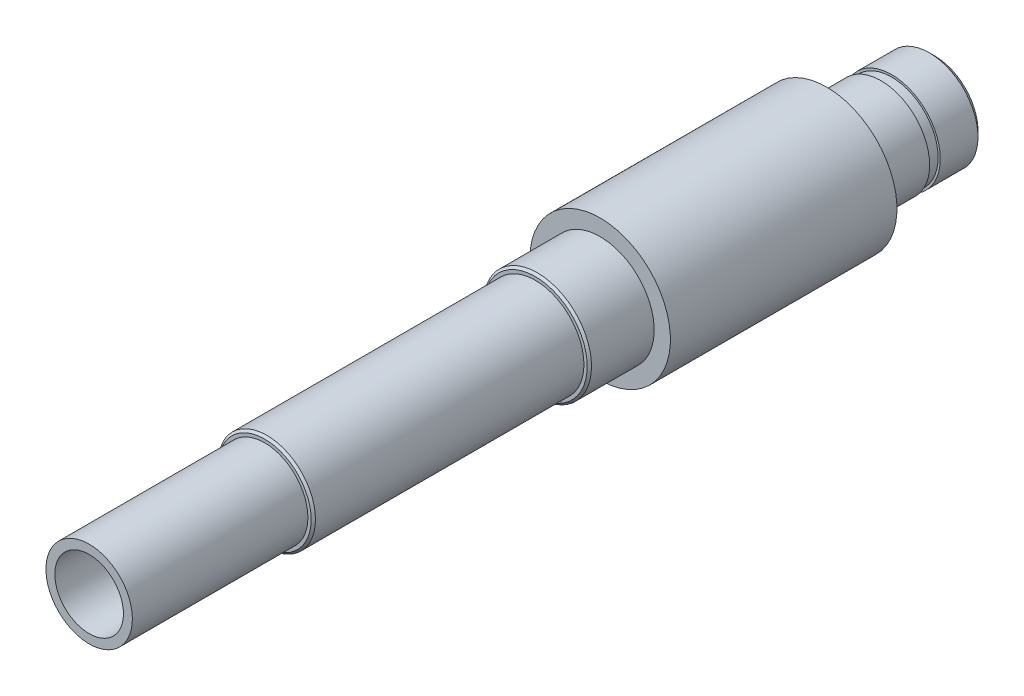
ISO-10303-21;
HEADER;
FILE_DESCRIPTION(('STEP AP214'),'2;1');
FILE_NAME('part.step','',(''),(''),'','','');
FILE_SCHEMA(('AUTOMOTIVE_DESIGN { 1 0 10303 214 1 1 1 1 }'));
ENDSEC;
DATA;
#1=APPLICATION_CONTEXT('core data for automotive mechanical design processes');
#2=APPLICATION_PROTOCOL_DEFINITION('international standard','automotive_design',2000,#1);
#3=PRODUCT_CONTEXT('',#1,'mechanical');
#4=PRODUCT('Part','Part','',(#3));
#5=PRODUCT_RELATED_PRODUCT_CATEGORY('part','',(#4));
#6=PRODUCT_DEFINITION_FORMATION('','',#4);
#7=PRODUCT_DEFINITION_CONTEXT('part definition',#1,'design');
#8=PRODUCT_DEFINITION('design','',#6,#7);
#9=PRODUCT_DEFINITION_SHAPE('','',#8);
#10=(LENGTH_UNIT() NAMED_UNIT(*) SI_UNIT(.MILLI.,.METRE.));
#11=(NAMED_UNIT(*) PLANE_ANGLE_UNIT() SI_UNIT($,.RADIAN.));
#12=(NAMED_UNIT(*) SI_UNIT($,.STERADIAN.) SOLID_ANGLE_UNIT());
#13=UNCERTAINTY_MEASURE_WITH_UNIT(LENGTH_MEASURE(1.E-05),#10,'distance_accuracy_value','');
#14=(GEOMETRIC_REPRESENTATION_CONTEXT(3) GLOBAL_UNCERTAINTY_ASSIGNED_CONTEXT((#13)) GLOBAL_UNIT_ASSIGNED_CONTEXT((#10,
#11,#12)) REPRESENTATION_CONTEXT('',''));
#15=CARTESIAN_POINT('',(0.,0.,0.));
#16=DIRECTION('',(0.,0.,1.));
#17=DIRECTION('',(1.,0.,0.));
#18=AXIS2_PLACEMENT_3D('',#15,#16,#17);
#19=CARTESIAN_POINT('',(0.,0.,-30.9646));
#20=DIRECTION('',(0.,0.,1.));
#21=DIRECTION('',(1.,0.,0.));
#22=AXIS2_PLACEMENT_3D('',#19,#20,#21);
#23=CYLINDRICAL_SURFACE('',#22,4.500000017);
#24=CARTESIAN_POINT('',(0.,0.,-30.4646));
#25=DIRECTION('',(0.,0.,-1.));
#26=DIRECTION('',(-1.,0.,0.));
#27=AXIS2_PLACEMENT_3D('',#24,#25,#26);
#28=CIRCLE('',#27,4.500000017);
#29=CARTESIAN_POINT('',(-4.500000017,0.,-30.4646));
#30=VERTEX_POINT('',#29);
#31=EDGE_CURVE('E10',#30,#30,#28,.F.);
#32=ORIENTED_EDGE('',*,*,#31,.T.);
#33=EDGE_LOOP('',(#32));
#34=FACE_BOUND('',#33,.T.);
#35=CARTESIAN_POINT('',(0.,0.,-26.9733753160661));
#36=DIRECTION('',(0.,0.,1.));
#37=DIRECTION('',(1.,0.,0.));
#38=AXIS2_PLACEMENT_3D('',#35,#36,#37);
#39=CIRCLE('',#38,4.500000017);
#40=CARTESIAN_POINT('',(4.500000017,0.,-26.9733753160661));
#41=VERTEX_POINT('',#40);
#42=EDGE_CURVE('E101',#41,#41,#39,.T.);
#43=ORIENTED_EDGE('',*,*,#42,.F.);
#44=EDGE_LOOP('',(#43));
#45=FACE_BOUND('',#44,.T.);
#46=ADVANCED_FACE('F39',(#34,#45),#23,.T.);
#47=CARTESIAN_POINT('',(0.,0.,-20.9646));
#48=DIRECTION('',(0.,0.,-1.));
#49=DIRECTION('',(-1.,0.,0.));
#50=AXIS2_PLACEMENT_3D('',#47,#48,#49);
#51=CIRCLE('',#50,4.500000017);
#52=CARTESIAN_POINT('',(-4.500000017,0.,-20.9646));
#53=VERTEX_POINT('',#52);
#54=EDGE_CURVE('E81',#53,#53,#51,.T.);
#55=ORIENTED_EDGE('',*,*,#54,.T.);
#56=EDGE_LOOP('',(#55));
#57=FACE_BOUND('',#56,.T.);
#58=CARTESIAN_POINT('',(0.,0.,-25.9896));
#59=DIRECTION('',(0.,0.,1.));
#60=DIRECTION('',(1.,0.,0.));
#61=AXIS2_PLACEMENT_3D('',#58,#59,#60);
#62=CIRCLE('',#61,4.500000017);
#63=CARTESIAN_POINT('',(4.500000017,0.,-25.9896));
#64=VERTEX_POINT('',#63);
#65=EDGE_CURVE('E98',#64,#64,#62,.T.);
#66=ORIENTED_EDGE('',*,*,#65,.T.);
#67=EDGE_LOOP('',(#66));
#68=FACE_BOUND('',#67,.T.);
#69=ADVANCED_FACE('F109',(#57,#68),#23,.T.);
#70=CARTESIAN_POINT('',(0.,0.,-20.9646));
#71=DIRECTION('',(0.,0.,-1.));
#72=DIRECTION('',(-1.,0.,0.));
#73=AXIS2_PLACEMENT_3D('',#70,#71,#72);
#74=PLANE('',#73);
#75=CARTESIAN_POINT('',(0.,0.,-20.9646));
#76=DIRECTION('',(0.,0.,-1.));
#77=DIRECTION('',(-1.,0.,0.));
#78=AXIS2_PLACEMENT_3D('',#75,#76,#77);
#79=CIRCLE('',#78,6.5);
#80=CARTESIAN_POINT('',(-6.5,0.,-20.9646));
#81=VERTEX_POINT('',#80);
#82=EDGE_CURVE('E71',#81,#81,#79,.T.);
#83=ORIENTED_EDGE('',*,*,#82,.T.);
#84=EDGE_LOOP('',(#83));
#85=FACE_BOUND('',#84,.T.);
#86=ORIENTED_EDGE('',*,*,#54,.F.);
#87=EDGE_LOOP('',(#86));
#88=FACE_BOUND('',#87,.T.);
#89=ADVANCED_FACE('F114',(#85,#88),#74,.T.);
#90=CARTESIAN_POINT('',(0.,0.,31.041));
#91=DIRECTION('',(0.,0.,1.));
#92=DIRECTION('',(1.,0.,0.));
#93=AXIS2_PLACEMENT_3D('',#90,#91,#92);
#94=PLANE('',#93);
#95=CARTESIAN_POINT('',(0.,0.,31.041));
#96=DIRECTION('',(0.,0.,1.));
#97=DIRECTION('',(1.,0.,0.));
#98=AXIS2_PLACEMENT_3D('',#95,#96,#97);
#99=CIRCLE('',#98,4.3);
#100=CARTESIAN_POINT('',(4.3,0.,31.041));
#101=VERTEX_POINT('',#100);
#102=EDGE_CURVE('E62',#101,#101,#99,.T.);
#103=ORIENTED_EDGE('',*,*,#102,.T.);
#104=EDGE_LOOP('',(#103));
#105=FACE_BOUND('',#104,.T.);
#106=CARTESIAN_POINT('',(0.,0.,31.041));
#107=DIRECTION('',(0.,0.,1.));
#108=DIRECTION('',(1.,0.,0.));
#109=AXIS2_PLACEMENT_3D('',#106,#107,#108);
#110=CIRCLE('',#109,4.);
#111=CARTESIAN_POINT('',(4.,0.,31.041));
#112=VERTEX_POINT('',#111);
#113=EDGE_CURVE('E78',#112,#112,#110,.T.);
#114=ORIENTED_EDGE('',*,*,#113,.F.);
#115=EDGE_LOOP('',(#114));
#116=FACE_BOUND('',#115,.T.);
#117=ADVANCED_FACE('F131',(#105,#116),#94,.T.);
#118=CARTESIAN_POINT('',(0.,0.,5.999));
#119=DIRECTION('',(0.,0.,1.));
#120=DIRECTION('',(1.,0.,0.));
#121=AXIS2_PLACEMENT_3D('',#118,#119,#120);
#122=PLANE('',#121);
#123=CARTESIAN_POINT('',(0.,0.,5.999));
#124=DIRECTION('',(0.,0.,1.));
#125=DIRECTION('',(1.,0.,0.));
#126=AXIS2_PLACEMENT_3D('',#123,#124,#125);
#127=CIRCLE('',#126,4.79999999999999);
#128=CARTESIAN_POINT('',(4.79999999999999,0.,5.999));
#129=VERTEX_POINT('',#128);
#130=EDGE_CURVE('E54',#129,#129,#127,.T.);
#131=ORIENTED_EDGE('',*,*,#130,.T.);
#132=EDGE_LOOP('',(#131));
#133=FACE_BOUND('',#132,.T.);
#134=CARTESIAN_POINT('',(0.,0.,5.999));
#135=DIRECTION('',(0.,0.,1.));
#136=DIRECTION('',(1.,0.,0.));
#137=AXIS2_PLACEMENT_3D('',#134,#135,#136);
#138=CIRCLE('',#137,4.5);
#139=CARTESIAN_POINT('',(4.5,0.,5.999));
#140=VERTEX_POINT('',#139);
#141=EDGE_CURVE('E65',#140,#140,#138,.T.);
#142=ORIENTED_EDGE('',*,*,#141,.F.);
#143=EDGE_LOOP('',(#142));
#144=FACE_BOUND('',#143,.T.);
#145=ADVANCED_FACE('F143',(#133,#144),#122,.T.);
#146=CARTESIAN_POINT('',(0.,0.,5.999));
#147=DIRECTION('',(0.,0.,-1.));
#148=DIRECTION('',(-1.,0.,0.));
#149=AXIS2_PLACEMENT_3D('',#146,#147,#148);
#150=CYLINDRICAL_SURFACE('',#149,5.);
#151=CARTESIAN_POINT('',(0.,0.,5.79899999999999));
#152=DIRECTION('',(0.,0.,1.));
#153=DIRECTION('',(1.,0.,0.));
#154=AXIS2_PLACEMENT_3D('',#151,#152,#153);
#155=CIRCLE('',#154,5.);
#156=CARTESIAN_POINT('',(5.,0.,5.79899999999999));
#157=VERTEX_POINT('',#156);
#158=EDGE_CURVE('E50',#157,#157,#155,.F.);
#159=ORIENTED_EDGE('',*,*,#158,.T.);
#160=EDGE_LOOP('',(#159));
#161=FACE_BOUND('',#160,.T.);
#162=CARTESIAN_POINT('',(0.,0.,-0.00100000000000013));
#163=DIRECTION('',(0.,0.,-1.));
#164=DIRECTION('',(-1.,0.,0.));
#165=AXIS2_PLACEMENT_3D('',#162,#163,#164);
#166=CIRCLE('',#165,5.);
#167=CARTESIAN_POINT('',(-5.,0.,-0.00100000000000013));
#168=VERTEX_POINT('',#167);
#169=EDGE_CURVE('E68',#168,#168,#166,.T.);
#170=ORIENTED_EDGE('',*,*,#169,.F.);
#171=EDGE_LOOP('',(#170));
#172=FACE_BOUND('',#171,.T.);
#173=ADVANCED_FACE('F147',(#161,#172),#150,.T.);
#174=CARTESIAN_POINT('',(0.,0.,31.041));
#175=DIRECTION('',(0.,0.,-1.));
#176=DIRECTION('',(-1.,0.,0.));
#177=AXIS2_PLACEMENT_3D('',#174,#175,#176);
#178=CYLINDRICAL_SURFACE('',#177,4.5);
#179=CARTESIAN_POINT('',(0.,0.,30.841));
#180=DIRECTION('',(0.,0.,1.));
#181=DIRECTION('',(1.,0.,0.));
#182=AXIS2_PLACEMENT_3D('',#179,#180,#181);
#183=CIRCLE('',#182,4.5);
#184=CARTESIAN_POINT('',(4.5,0.,30.841));
#185=VERTEX_POINT('',#184);
#186=EDGE_CURVE('E59',#185,#185,#183,.F.);
#187=ORIENTED_EDGE('',*,*,#186,.T.);
#188=EDGE_LOOP('',(#187));
#189=FACE_BOUND('',#188,.T.);
#190=ORIENTED_EDGE('',*,*,#141,.T.);
#191=EDGE_LOOP('',(#190));
#192=FACE_BOUND('',#191,.T.);
#193=ADVANCED_FACE('F136',(#189,#192),#178,.T.);
#194=CARTESIAN_POINT('',(0.,0.,-0.001));
#195=DIRECTION('',(0.,0.,-1.));
#196=DIRECTION('',(-1.,0.,0.));
#197=AXIS2_PLACEMENT_3D('',#194,#195,#196);
#198=PLANE('',#197);
#199=CARTESIAN_POINT('',(0.,0.,-0.001));
#200=DIRECTION('',(0.,0.,-1.));
#201=DIRECTION('',(-1.,0.,0.));
#202=AXIS2_PLACEMENT_3D('',#199,#200,#201);
#203=CIRCLE('',#202,6.5);
#204=CARTESIAN_POINT('',(-6.5,0.,-0.001));
#205=VERTEX_POINT('',#204);
#206=EDGE_CURVE('E72',#205,#205,#203,.T.);
#207=ORIENTED_EDGE('',*,*,#206,.F.);
#208=EDGE_LOOP('',(#207));
#209=FACE_BOUND('',#208,.T.);
#210=ORIENTED_EDGE('',*,*,#169,.T.);
#211=EDGE_LOOP('',(#210));
#212=FACE_BOUND('',#211,.T.);
#213=ADVANCED_FACE('F133',(#209,#212),#198,.F.);
#214=CARTESIAN_POINT('',(0.,0.,-20.9646));
#215=DIRECTION('',(0.,0.,1.));
#216=DIRECTION('',(1.,0.,0.));
#217=AXIS2_PLACEMENT_3D('',#214,#215,#216);
#218=CYLINDRICAL_SURFACE('',#217,6.5);
#219=ORIENTED_EDGE('',*,*,#82,.F.);
#220=EDGE_LOOP('',(#219));
#221=FACE_BOUND('',#220,.T.);
#222=ORIENTED_EDGE('',*,*,#206,.T.);
#223=EDGE_LOOP('',(#222));
#224=FACE_BOUND('',#223,.T.);
#225=ADVANCED_FACE('F127',(#221,#224),#218,.T.);
#226=CARTESIAN_POINT('',(0.,0.,47.283));
#227=DIRECTION('',(0.,0.,-1.));
#228=DIRECTION('',(-1.,0.,0.));
#229=AXIS2_PLACEMENT_3D('',#226,#227,#228);
#230=CYLINDRICAL_SURFACE('',#229,4.);
#231=CARTESIAN_POINT('',(0.,0.,47.283));
#232=DIRECTION('',(0.,0.,1.));
#233=DIRECTION('',(1.,0.,0.));
#234=AXIS2_PLACEMENT_3D('',#231,#232,#233);
#235=CIRCLE('',#234,4.);
#236=CARTESIAN_POINT('',(4.,0.,47.283));
#237=VERTEX_POINT('',#236);
#238=EDGE_CURVE('E75',#237,#237,#235,.T.);
#239=ORIENTED_EDGE('',*,*,#238,.F.);
#240=EDGE_LOOP('',(#239));
#241=FACE_BOUND('',#240,.T.);
#242=ORIENTED_EDGE('',*,*,#113,.T.);
#243=EDGE_LOOP('',(#242));
#244=FACE_BOUND('',#243,.T.);
#245=ADVANCED_FACE('F123',(#241,#244),#230,.T.);
#246=CARTESIAN_POINT('',(0.,0.,47.283));
#247=DIRECTION('',(0.,0.,1.));
#248=DIRECTION('',(1.,0.,0.));
#249=AXIS2_PLACEMENT_3D('',#246,#247,#248);
#250=PLANE('',#249);
#251=CARTESIAN_POINT('',(0.,0.,47.283));
#252=DIRECTION('',(0.,0.,1.));
#253=DIRECTION('',(1.,0.,0.));
#254=AXIS2_PLACEMENT_3D('',#251,#252,#253);
#255=CIRCLE('',#254,3.1755);
#256=CARTESIAN_POINT('',(3.1755,0.,47.283));
#257=VERTEX_POINT('',#256);
#258=EDGE_CURVE('E89',#257,#257,#255,.T.);
#259=ORIENTED_EDGE('',*,*,#258,.F.);
#260=EDGE_LOOP('',(#259));
#261=FACE_BOUND('',#260,.T.);
#262=ORIENTED_EDGE('',*,*,#238,.T.);
#263=EDGE_LOOP('',(#262));
#264=FACE_BOUND('',#263,.T.);
#265=ADVANCED_FACE('F120',(#261,#264),#250,.T.);
#266=CARTESIAN_POINT('',(0.,0.,-30.9646));
#267=DIRECTION('',(0.,0.,-1.));
#268=DIRECTION('',(-1.,0.,0.));
#269=AXIS2_PLACEMENT_3D('',#266,#267,#268);
#270=PLANE('',#269);
#271=CARTESIAN_POINT('',(0.,0.,-30.9646));
#272=DIRECTION('',(0.,0.,-1.));
#273=DIRECTION('',(-1.,0.,0.));
#274=AXIS2_PLACEMENT_3D('',#271,#272,#273);
#275=CIRCLE('',#274,4.00000001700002);
#276=CARTESIAN_POINT('',(-4.00000001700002,0.,-30.9646));
#277=VERTEX_POINT('',#276);
#278=EDGE_CURVE('E46',#277,#277,#275,.T.);
#279=ORIENTED_EDGE('',*,*,#278,.T.);
#280=EDGE_LOOP('',(#279));
#281=FACE_BOUND('',#280,.T.);
#282=CARTESIAN_POINT('',(0.,0.,-30.9646));
#283=DIRECTION('',(0.,0.,1.));
#284=DIRECTION('',(1.,0.,0.));
#285=AXIS2_PLACEMENT_3D('',#282,#283,#284);
#286=CIRCLE('',#285,3.1755);
#287=CARTESIAN_POINT('',(3.1755,0.,-30.9646));
#288=VERTEX_POINT('',#287);
#289=EDGE_CURVE('E86',#288,#288,#286,.T.);
#290=ORIENTED_EDGE('',*,*,#289,.T.);
#291=EDGE_LOOP('',(#290));
#292=FACE_BOUND('',#291,.T.);
#293=ADVANCED_FACE('F118',(#281,#292),#270,.T.);
#294=CARTESIAN_POINT('',(0.,0.,-30.9646));
#295=DIRECTION('',(0.,0.,1.));
#296=DIRECTION('',(1.,0.,0.));
#297=AXIS2_PLACEMENT_3D('',#294,#295,#296);
#298=CYLINDRICAL_SURFACE('',#297,3.1755);
#299=ORIENTED_EDGE('',*,*,#289,.F.);
#300=EDGE_LOOP('',(#299));
#301=FACE_BOUND('',#300,.T.);
#302=ORIENTED_EDGE('',*,*,#258,.T.);
#303=EDGE_LOOP('',(#302));
#304=FACE_BOUND('',#303,.T.);
#305=ADVANCED_FACE('F188',(#301,#304),#298,.F.);
#306=CARTESIAN_POINT('',(0.,4.500000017,-26.9733753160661));
#307=DIRECTION('',(0.,0.,1.));
#308=DIRECTION('',(1.,0.,0.));
#309=AXIS2_PLACEMENT_3D('',#306,#307,#308);
#310=PLANE('',#309);
#311=ORIENTED_EDGE('',*,*,#42,.T.);
#312=EDGE_LOOP('',(#311));
#313=FACE_BOUND('',#312,.T.);
#314=CARTESIAN_POINT('',(0.,0.,-26.9733753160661));
#315=DIRECTION('',(0.,0.,1.));
#316=DIRECTION('',(1.,0.,0.));
#317=AXIS2_PLACEMENT_3D('',#314,#315,#316);
#318=CIRCLE('',#317,4.3);
#319=CARTESIAN_POINT('',(4.3,0.,-26.9733753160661));
#320=VERTEX_POINT('',#319);
#321=EDGE_CURVE('E92',#320,#320,#318,.T.);
#322=ORIENTED_EDGE('',*,*,#321,.F.);
#323=EDGE_LOOP('',(#322));
#324=FACE_BOUND('',#323,.T.);
#325=ADVANCED_FACE('F105',(#313,#324),#310,.T.);
#326=CARTESIAN_POINT('',(0.,0.,0.));
#327=DIRECTION('',(0.,0.,1.));
#328=DIRECTION('',(1.,0.,0.));
#329=AXIS2_PLACEMENT_3D('',#326,#327,#328);
#330=CYLINDRICAL_SURFACE('',#329,4.3);
#331=ORIENTED_EDGE('',*,*,#321,.T.);
#332=EDGE_LOOP('',(#331));
#333=FACE_BOUND('',#332,.T.);
#334=CARTESIAN_POINT('',(0.,0.,-25.9896));
#335=DIRECTION('',(0.,0.,1.));
#336=DIRECTION('',(1.,0.,0.));
#337=AXIS2_PLACEMENT_3D('',#334,#335,#336);
#338=CIRCLE('',#337,4.3);
#339=CARTESIAN_POINT('',(4.3,0.,-25.9896));
#340=VERTEX_POINT('',#339);
#341=EDGE_CURVE('E95',#340,#340,#338,.T.);
#342=ORIENTED_EDGE('',*,*,#341,.F.);
#343=EDGE_LOOP('',(#342));
#344=FACE_BOUND('',#343,.T.);
#345=ADVANCED_FACE('F247',(#333,#344),#330,.T.);
#346=CARTESIAN_POINT('',(0.,4.500000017,-25.9896));
#347=DIRECTION('',(0.,0.,-1.));
#348=DIRECTION('',(-1.,0.,0.));
#349=AXIS2_PLACEMENT_3D('',#346,#347,#348);
#350=PLANE('',#349);
#351=ORIENTED_EDGE('',*,*,#341,.T.);
#352=EDGE_LOOP('',(#351));
#353=FACE_BOUND('',#352,.T.);
#354=ORIENTED_EDGE('',*,*,#65,.F.);
#355=EDGE_LOOP('',(#354));
#356=FACE_BOUND('',#355,.T.);
#357=ADVANCED_FACE('F158',(#353,#356),#350,.T.);
#358=CARTESIAN_POINT('',(0.,0.,31.041));
#359=DIRECTION('',(0.,0.,-1.));
#360=DIRECTION('',(-1.,0.,0.));
#361=AXIS2_PLACEMENT_3D('',#358,#359,#360);
#362=CONICAL_SURFACE('',#361,4.3,0.785398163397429);
#363=ORIENTED_EDGE('',*,*,#186,.F.);
#364=EDGE_LOOP('',(#363));
#365=FACE_BOUND('',#364,.T.);
#366=ORIENTED_EDGE('',*,*,#102,.F.);
#367=EDGE_LOOP('',(#366));
#368=FACE_BOUND('',#367,.T.);
#369=ADVANCED_FACE('F155',(#365,#368),#362,.T.);
#370=CARTESIAN_POINT('',(0.,0.,5.999));
#371=DIRECTION('',(0.,0.,-1.));
#372=DIRECTION('',(-1.,0.,0.));
#373=AXIS2_PLACEMENT_3D('',#370,#371,#372);
#374=CONICAL_SURFACE('',#373,4.79999999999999,0.78539816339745);
#375=ORIENTED_EDGE('',*,*,#158,.F.);
#376=EDGE_LOOP('',(#375));
#377=FACE_BOUND('',#376,.T.);
#378=ORIENTED_EDGE('',*,*,#130,.F.);
#379=EDGE_LOOP('',(#378));
#380=FACE_BOUND('',#379,.T.);
#381=ADVANCED_FACE('F157',(#377,#380),#374,.T.);
#382=CARTESIAN_POINT('',(0.,0.,-30.9646));
#383=DIRECTION('',(0.,0.,1.));
#384=DIRECTION('',(1.,0.,0.));
#385=AXIS2_PLACEMENT_3D('',#382,#383,#384);
#386=CONICAL_SURFACE('',#385,4.00000001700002,0.785398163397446);
#387=ORIENTED_EDGE('',*,*,#31,.F.);
#388=EDGE_LOOP('',(#387));
#389=FACE_BOUND('',#388,.T.);
#390=ORIENTED_EDGE('',*,*,#278,.F.);
#391=EDGE_LOOP('',(#390));
#392=FACE_BOUND('',#391,.T.);
#393=ADVANCED_FACE('F41',(#389,#392),#386,.T.);
#394=CLOSED_SHELL('',(#46,#69,#89,#117,#145,#173,#193,#213,#225,#245,#265,#293,#305,#325,#345,
#357,#369,#381,#393));
#395=MANIFOLD_SOLID_BREP('B2',#394);
#396=ADVANCED_BREP_SHAPE_REPRESENTATION('',(#18,#395),#14);
#397=SHAPE_DEFINITION_REPRESENTATION(#9,#396);
ENDSEC;
END-ISO-10303-21;
